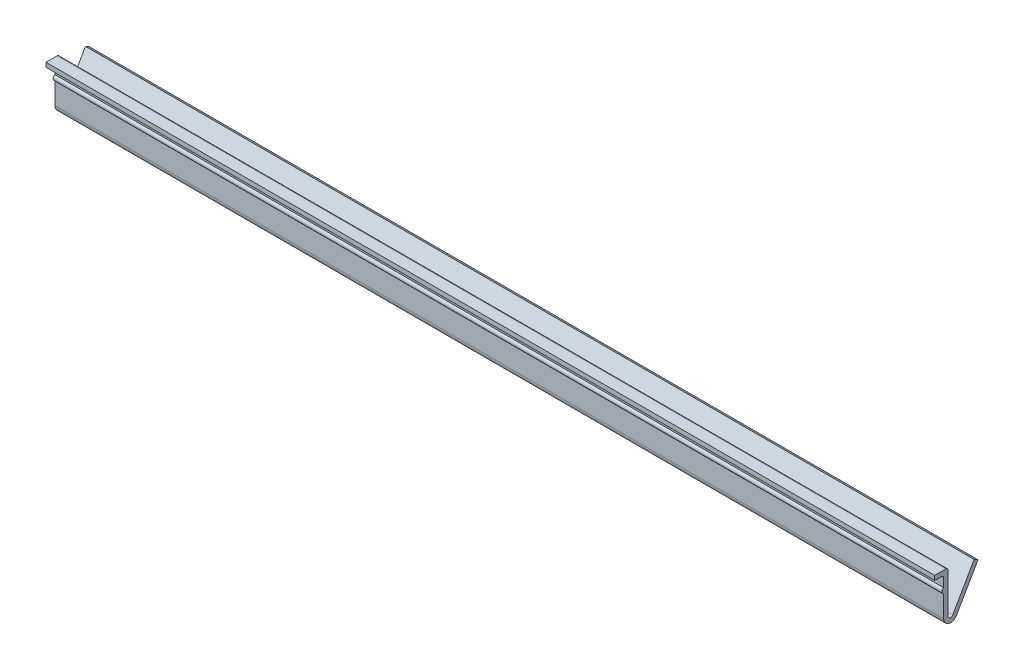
ISO-10303-21;
HEADER;
FILE_DESCRIPTION(('STEP AP214'),'2;1');
FILE_NAME('part.step','',(''),(''),'','','');
FILE_SCHEMA(('AUTOMOTIVE_DESIGN { 1 0 10303 214 1 1 1 1 }'));
ENDSEC;
DATA;
#1=APPLICATION_CONTEXT('core data for automotive mechanical design processes');
#2=APPLICATION_PROTOCOL_DEFINITION('international standard','automotive_design',2000,#1);
#3=PRODUCT_CONTEXT('',#1,'mechanical');
#4=PRODUCT('Part','Part','',(#3));
#5=PRODUCT_RELATED_PRODUCT_CATEGORY('part','',(#4));
#6=PRODUCT_DEFINITION_FORMATION('','',#4);
#7=PRODUCT_DEFINITION_CONTEXT('part definition',#1,'design');
#8=PRODUCT_DEFINITION('design','',#6,#7);
#9=PRODUCT_DEFINITION_SHAPE('','',#8);
#10=(LENGTH_UNIT() NAMED_UNIT(*) SI_UNIT(.MILLI.,.METRE.));
#11=(NAMED_UNIT(*) PLANE_ANGLE_UNIT() SI_UNIT($,.RADIAN.));
#12=(NAMED_UNIT(*) SI_UNIT($,.STERADIAN.) SOLID_ANGLE_UNIT());
#13=UNCERTAINTY_MEASURE_WITH_UNIT(LENGTH_MEASURE(1.E-05),#10,'distance_accuracy_value','');
#14=(GEOMETRIC_REPRESENTATION_CONTEXT(3) GLOBAL_UNCERTAINTY_ASSIGNED_CONTEXT((#13)) GLOBAL_UNIT_ASSIGNED_CONTEXT((#10,
#11,#12)) REPRESENTATION_CONTEXT('',''));
#15=CARTESIAN_POINT('',(0.,0.,0.));
#16=DIRECTION('',(0.,0.,1.));
#17=DIRECTION('',(1.,0.,0.));
#18=AXIS2_PLACEMENT_3D('',#15,#16,#17);
#19=CARTESIAN_POINT('',(200.,6.11762039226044,5.94354760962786));
#20=DIRECTION('',(0.,0.,-1.));
#21=DIRECTION('',(-1.,0.,0.));
#22=AXIS2_PLACEMENT_3D('',#19,#20,#21);
#23=PLANE('',#22);
#24=DIRECTION('',(0.,-1.,0.));
#25=VECTOR('',#24,1.);
#26=CARTESIAN_POINT('',(0.,6.11762039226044,5.94354760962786));
#27=LINE('',#26,#25);
#28=CARTESIAN_POINT('',(0.,6.11762039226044,5.94354760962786));
#29=VERTEX_POINT('',#28);
#30=CARTESIAN_POINT('',(0.,5.11762039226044,5.94354760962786));
#31=VERTEX_POINT('',#30);
#32=EDGE_CURVE('E236',#29,#31,#27,.T.);
#33=ORIENTED_EDGE('',*,*,#32,.T.);
#34=DIRECTION('',(-1.,0.,0.));
#35=VECTOR('',#34,1.);
#36=CARTESIAN_POINT('',(200.,5.11762039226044,5.94354760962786));
#37=LINE('',#36,#35);
#38=CARTESIAN_POINT('',(200.,5.11762039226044,5.94354760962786));
#39=VERTEX_POINT('',#38);
#40=EDGE_CURVE('E13',#39,#31,#37,.T.);
#41=ORIENTED_EDGE('',*,*,#40,.F.);
#42=DIRECTION('',(0.,-1.,0.));
#43=VECTOR('',#42,1.);
#44=CARTESIAN_POINT('',(200.,6.11762039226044,5.94354760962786));
#45=LINE('',#44,#43);
#46=CARTESIAN_POINT('',(200.,6.11762039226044,5.94354760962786));
#47=VERTEX_POINT('',#46);
#48=EDGE_CURVE('E276',#47,#39,#45,.T.);
#49=ORIENTED_EDGE('',*,*,#48,.F.);
#50=DIRECTION('',(-1.,0.,0.));
#51=VECTOR('',#50,1.);
#52=CARTESIAN_POINT('',(200.,6.11762039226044,5.94354760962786));
#53=LINE('',#52,#51);
#54=EDGE_CURVE('E232',#47,#29,#53,.T.);
#55=ORIENTED_EDGE('',*,*,#54,.T.);
#56=EDGE_LOOP('',(#33,#41,#49,#55));
#57=FACE_BOUND('',#56,.T.);
#58=ADVANCED_FACE('F96',(#57),#23,.F.);
#59=CARTESIAN_POINT('',(200.,5.11762039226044,5.94354760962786));
#60=DIRECTION('',(0.,1.,0.));
#61=DIRECTION('',(0.,0.,1.));
#62=AXIS2_PLACEMENT_3D('',#59,#60,#61);
#63=PLANE('',#62);
#64=DIRECTION('',(0.,0.,-1.));
#65=VECTOR('',#64,1.);
#66=CARTESIAN_POINT('',(0.,5.11762039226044,5.94354760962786));
#67=LINE('',#66,#65);
#68=CARTESIAN_POINT('',(0.,5.11762039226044,4.44354760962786));
#69=VERTEX_POINT('',#68);
#70=EDGE_CURVE('E240',#31,#69,#67,.T.);
#71=ORIENTED_EDGE('',*,*,#70,.T.);
#72=DIRECTION('',(-1.,0.,0.));
#73=VECTOR('',#72,1.);
#74=CARTESIAN_POINT('',(200.,5.11762039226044,4.44354760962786));
#75=LINE('',#74,#73);
#76=CARTESIAN_POINT('',(200.,5.11762039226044,4.44354760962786));
#77=VERTEX_POINT('',#76);
#78=EDGE_CURVE('E105',#77,#69,#75,.T.);
#79=ORIENTED_EDGE('',*,*,#78,.F.);
#80=DIRECTION('',(0.,0.,-1.));
#81=VECTOR('',#80,1.);
#82=CARTESIAN_POINT('',(200.,5.11762039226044,5.94354760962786));
#83=LINE('',#82,#81);
#84=EDGE_CURVE('E174',#39,#77,#83,.T.);
#85=ORIENTED_EDGE('',*,*,#84,.F.);
#86=ORIENTED_EDGE('',*,*,#40,.T.);
#87=EDGE_LOOP('',(#71,#79,#85,#86));
#88=FACE_BOUND('',#87,.T.);
#89=ADVANCED_FACE('F407',(#88),#63,.F.);
#90=CARTESIAN_POINT('',(200.,4.61762039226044,4.44354760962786));
#91=DIRECTION('',(-1.,0.,0.));
#92=DIRECTION('',(0.,0.,1.));
#93=AXIS2_PLACEMENT_3D('',#90,#91,#92);
#94=CYLINDRICAL_SURFACE('',#93,0.5);
#95=CARTESIAN_POINT('',(0.,4.61762039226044,4.44354760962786));
#96=DIRECTION('',(-1.,0.,0.));
#97=DIRECTION('',(0.,0.,1.));
#98=AXIS2_PLACEMENT_3D('',#95,#96,#97);
#99=CIRCLE('',#98,0.5);
#100=CARTESIAN_POINT('',(0.,4.61762039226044,3.94354760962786));
#101=VERTEX_POINT('',#100);
#102=EDGE_CURVE('E243',#69,#101,#99,.T.);
#103=ORIENTED_EDGE('',*,*,#102,.T.);
#104=DIRECTION('',(-1.,0.,0.));
#105=VECTOR('',#104,1.);
#106=CARTESIAN_POINT('',(200.,4.61762039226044,3.94354760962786));
#107=LINE('',#106,#105);
#108=CARTESIAN_POINT('',(200.,4.61762039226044,3.94354760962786));
#109=VERTEX_POINT('',#108);
#110=EDGE_CURVE('E311',#109,#101,#107,.T.);
#111=ORIENTED_EDGE('',*,*,#110,.F.);
#112=CARTESIAN_POINT('',(200.,4.61762039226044,4.44354760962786));
#113=DIRECTION('',(-1.,0.,0.));
#114=DIRECTION('',(0.,0.,1.));
#115=AXIS2_PLACEMENT_3D('',#112,#113,#114);
#116=CIRCLE('',#115,0.5);
#117=EDGE_CURVE('E322',#77,#109,#116,.T.);
#118=ORIENTED_EDGE('',*,*,#117,.F.);
#119=ORIENTED_EDGE('',*,*,#78,.T.);
#120=EDGE_LOOP('',(#103,#111,#118,#119));
#121=FACE_BOUND('',#120,.T.);
#122=ADVANCED_FACE('F320',(#121),#94,.F.);
#123=CARTESIAN_POINT('',(200.,4.61762039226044,3.94354760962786));
#124=DIRECTION('',(0.,0.,-1.));
#125=DIRECTION('',(0.,1.,0.));
#126=AXIS2_PLACEMENT_3D('',#123,#124,#125);
#127=PLANE('',#126);
#128=DIRECTION('',(0.,-1.,0.));
#129=VECTOR('',#128,1.);
#130=CARTESIAN_POINT('',(0.,4.61762039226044,3.94354760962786));
#131=LINE('',#130,#129);
#132=CARTESIAN_POINT('',(0.,2.71736327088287,3.94354760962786));
#133=VERTEX_POINT('',#132);
#134=EDGE_CURVE('E246',#101,#133,#131,.T.);
#135=ORIENTED_EDGE('',*,*,#134,.T.);
#136=DIRECTION('',(-1.,0.,0.));
#137=VECTOR('',#136,1.);
#138=CARTESIAN_POINT('',(200.,2.71736327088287,3.94354760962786));
#139=LINE('',#138,#137);
#140=CARTESIAN_POINT('',(200.,2.71736327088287,3.94354760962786));
#141=VERTEX_POINT('',#140);
#142=EDGE_CURVE('E307',#141,#133,#139,.T.);
#143=ORIENTED_EDGE('',*,*,#142,.F.);
#144=DIRECTION('',(0.,-1.,0.));
#145=VECTOR('',#144,1.);
#146=CARTESIAN_POINT('',(200.,4.61762039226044,3.94354760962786));
#147=LINE('',#146,#145);
#148=EDGE_CURVE('E341',#109,#141,#147,.T.);
#149=ORIENTED_EDGE('',*,*,#148,.F.);
#150=ORIENTED_EDGE('',*,*,#110,.T.);
#151=EDGE_LOOP('',(#135,#143,#149,#150));
#152=FACE_BOUND('',#151,.T.);
#153=ADVANCED_FACE('F331',(#152),#127,.F.);
#154=CARTESIAN_POINT('',(200.,2.11762039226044,3.69293140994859));
#155=DIRECTION('',(-1.,0.,0.));
#156=DIRECTION('',(0.,0.,1.));
#157=AXIS2_PLACEMENT_3D('',#154,#155,#156);
#158=CYLINDRICAL_SURFACE('',#157,0.65);
#159=CARTESIAN_POINT('',(0.,2.11762039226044,3.69293140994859));
#160=DIRECTION('',(1.,0.,0.));
#161=DIRECTION('',(0.,0.,-1.));
#162=AXIS2_PLACEMENT_3D('',#159,#160,#161);
#163=CIRCLE('',#162,0.65);
#164=CARTESIAN_POINT('',(0.,1.517877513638,3.94354760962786));
#165=VERTEX_POINT('',#164);
#166=EDGE_CURVE('E249',#133,#165,#163,.T.);
#167=ORIENTED_EDGE('',*,*,#166,.T.);
#168=DIRECTION('',(-1.,0.,0.));
#169=VECTOR('',#168,1.);
#170=CARTESIAN_POINT('',(200.,1.517877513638,3.94354760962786));
#171=LINE('',#170,#169);
#172=CARTESIAN_POINT('',(200.,1.517877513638,3.94354760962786));
#173=VERTEX_POINT('',#172);
#174=EDGE_CURVE('E303',#173,#165,#171,.T.);
#175=ORIENTED_EDGE('',*,*,#174,.F.);
#176=CARTESIAN_POINT('',(200.,2.11762039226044,3.69293140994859));
#177=DIRECTION('',(1.,0.,0.));
#178=DIRECTION('',(0.,0.,-1.));
#179=AXIS2_PLACEMENT_3D('',#176,#177,#178);
#180=CIRCLE('',#179,0.65);
#181=EDGE_CURVE('E337',#141,#173,#180,.T.);
#182=ORIENTED_EDGE('',*,*,#181,.F.);
#183=ORIENTED_EDGE('',*,*,#142,.T.);
#184=EDGE_LOOP('',(#167,#175,#182,#183));
#185=FACE_BOUND('',#184,.T.);
#186=ADVANCED_FACE('F335',(#185),#158,.T.);
#187=CARTESIAN_POINT('',(200.,1.517877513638,3.94354760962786));
#188=DIRECTION('',(0.,0.,-1.));
#189=DIRECTION('',(0.,1.,0.));
#190=AXIS2_PLACEMENT_3D('',#187,#188,#189);
#191=PLANE('',#190);
#192=DIRECTION('',(0.,-1.,0.));
#193=VECTOR('',#192,1.);
#194=CARTESIAN_POINT('',(0.,1.517877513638,3.94354760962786));
#195=LINE('',#194,#193);
#196=CARTESIAN_POINT('',(0.,-3.33533918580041,3.94354760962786));
#197=VERTEX_POINT('',#196);
#198=EDGE_CURVE('E252',#165,#197,#195,.T.);
#199=ORIENTED_EDGE('',*,*,#198,.T.);
#200=DIRECTION('',(-1.,0.,0.));
#201=VECTOR('',#200,1.);
#202=CARTESIAN_POINT('',(200.,-3.33533918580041,3.94354760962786));
#203=LINE('',#202,#201);
#204=CARTESIAN_POINT('',(200.,-3.33533918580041,3.94354760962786));
#205=VERTEX_POINT('',#204);
#206=EDGE_CURVE('E299',#205,#197,#203,.T.);
#207=ORIENTED_EDGE('',*,*,#206,.F.);
#208=DIRECTION('',(0.,-1.,0.));
#209=VECTOR('',#208,1.);
#210=CARTESIAN_POINT('',(200.,1.517877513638,3.94354760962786));
#211=LINE('',#210,#209);
#212=EDGE_CURVE('E340',#173,#205,#211,.T.);
#213=ORIENTED_EDGE('',*,*,#212,.F.);
#214=ORIENTED_EDGE('',*,*,#174,.T.);
#215=EDGE_LOOP('',(#199,#207,#213,#214));
#216=FACE_BOUND('',#215,.T.);
#217=ADVANCED_FACE('F419',(#216),#191,.F.);
#218=CARTESIAN_POINT('',(200.,-3.33533918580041,2.37739924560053));
#219=DIRECTION('',(-1.,0.,0.));
#220=DIRECTION('',(0.,0.,1.));
#221=AXIS2_PLACEMENT_3D('',#218,#219,#220);
#222=CYLINDRICAL_SURFACE('',#221,1.56614836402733);
#223=CARTESIAN_POINT('',(0.,-3.33533918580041,2.37739924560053));
#224=DIRECTION('',(1.,0.,0.));
#225=DIRECTION('',(0.,0.,-1.));
#226=AXIS2_PLACEMENT_3D('',#223,#224,#225);
#227=CIRCLE('',#226,1.56614836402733);
#228=CARTESIAN_POINT('',(0.,-4.11501340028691,1.01911767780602));
#229=VERTEX_POINT('',#228);
#230=EDGE_CURVE('E255',#197,#229,#227,.T.);
#231=ORIENTED_EDGE('',*,*,#230,.T.);
#232=DIRECTION('',(-1.,0.,0.));
#233=VECTOR('',#232,1.);
#234=CARTESIAN_POINT('',(200.,-4.11501340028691,1.01911767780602));
#235=LINE('',#234,#233);
#236=CARTESIAN_POINT('',(200.,-4.11501340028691,1.01911767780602));
#237=VERTEX_POINT('',#236);
#238=EDGE_CURVE('E295',#237,#229,#235,.T.);
#239=ORIENTED_EDGE('',*,*,#238,.F.);
#240=CARTESIAN_POINT('',(200.,-3.33533918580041,2.37739924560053));
#241=DIRECTION('',(1.,0.,0.));
#242=DIRECTION('',(0.,0.,-1.));
#243=AXIS2_PLACEMENT_3D('',#240,#241,#242);
#244=CIRCLE('',#243,1.56614836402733);
#245=EDGE_CURVE('E347',#205,#237,#244,.T.);
#246=ORIENTED_EDGE('',*,*,#245,.F.);
#247=ORIENTED_EDGE('',*,*,#206,.T.);
#248=EDGE_LOOP('',(#231,#239,#246,#247));
#249=FACE_BOUND('',#248,.T.);
#250=ADVANCED_FACE('F422',(#249),#222,.T.);
#251=CARTESIAN_POINT('',(200.,-4.11501340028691,1.01911767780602));
#252=DIRECTION('',(0.,0.497829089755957,0.867275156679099));
#253=DIRECTION('',(0.,-0.867275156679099,0.497829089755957));
#254=AXIS2_PLACEMENT_3D('',#251,#252,#253);
#255=PLANE('',#254);
#256=DIRECTION('',(0.,0.867275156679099,-0.497829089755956));
#257=VECTOR('',#256,1.);
#258=CARTESIAN_POINT('',(0.,-4.11501340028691,1.01911767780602));
#259=LINE('',#258,#257);
#260=CARTESIAN_POINT('',(0.,4.2795649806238,-3.79949759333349));
#261=VERTEX_POINT('',#260);
#262=EDGE_CURVE('E258',#229,#261,#259,.T.);
#263=ORIENTED_EDGE('',*,*,#262,.T.);
#264=DIRECTION('',(-1.,0.,0.));
#265=VECTOR('',#264,1.);
#266=CARTESIAN_POINT('',(200.,4.2795649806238,-3.79949759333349));
#267=LINE('',#266,#265);
#268=CARTESIAN_POINT('',(200.,4.2795649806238,-3.79949759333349));
#269=VERTEX_POINT('',#268);
#270=EDGE_CURVE('E291',#269,#261,#267,.T.);
#271=ORIENTED_EDGE('',*,*,#270,.F.);
#272=DIRECTION('',(0.,0.867275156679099,-0.497829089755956));
#273=VECTOR('',#272,1.);
#274=CARTESIAN_POINT('',(200.,-4.11501340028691,1.01911767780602));
#275=LINE('',#274,#273);
#276=EDGE_CURVE('E355',#237,#269,#275,.T.);
#277=ORIENTED_EDGE('',*,*,#276,.F.);
#278=ORIENTED_EDGE('',*,*,#238,.T.);
#279=EDGE_LOOP('',(#263,#271,#277,#278));
#280=FACE_BOUND('',#279,.T.);
#281=ADVANCED_FACE('F426',(#280),#255,.F.);
#282=CARTESIAN_POINT('',(200.,4.77739407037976,-2.93222243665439));
#283=DIRECTION('',(0.,-0.867275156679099,0.497829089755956));
#284=DIRECTION('',(0.,-0.497829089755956,-0.867275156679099));
#285=AXIS2_PLACEMENT_3D('',#282,#283,#284);
#286=PLANE('',#285);
#287=DIRECTION('',(0.,0.497829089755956,0.867275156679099));
#288=VECTOR('',#287,1.);
#289=CARTESIAN_POINT('',(0.,4.77739407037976,-2.93222243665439));
#290=LINE('',#289,#288);
#291=CARTESIAN_POINT('',(0.,4.77739407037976,-2.93222243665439));
#292=VERTEX_POINT('',#291);
#293=EDGE_CURVE('E261',#261,#292,#290,.T.);
#294=ORIENTED_EDGE('',*,*,#293,.T.);
#295=DIRECTION('',(-1.,0.,0.));
#296=VECTOR('',#295,1.);
#297=CARTESIAN_POINT('',(200.,4.77739407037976,-2.93222243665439));
#298=LINE('',#297,#296);
#299=CARTESIAN_POINT('',(200.,4.77739407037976,-2.93222243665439));
#300=VERTEX_POINT('',#299);
#301=EDGE_CURVE('E287',#300,#292,#298,.T.);
#302=ORIENTED_EDGE('',*,*,#301,.F.);
#303=DIRECTION('',(0.,0.497829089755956,0.867275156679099));
#304=VECTOR('',#303,1.);
#305=CARTESIAN_POINT('',(200.,4.77739407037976,-2.93222243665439));
#306=LINE('',#305,#304);
#307=EDGE_CURVE('E357',#269,#300,#306,.T.);
#308=ORIENTED_EDGE('',*,*,#307,.F.);
#309=ORIENTED_EDGE('',*,*,#270,.T.);
#310=EDGE_LOOP('',(#294,#302,#308,#309));
#311=FACE_BOUND('',#310,.T.);
#312=ADVANCED_FACE('F430',(#311),#286,.F.);
#313=CARTESIAN_POINT('',(200.,-3.61718431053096,1.88639283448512));
#314=DIRECTION('',(0.,-0.497829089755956,-0.867275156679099));
#315=DIRECTION('',(0.,0.867275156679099,-0.497829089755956));
#316=AXIS2_PLACEMENT_3D('',#313,#314,#315);
#317=PLANE('',#316);
#318=DIRECTION('',(0.,-0.867275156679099,0.497829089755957));
#319=VECTOR('',#318,1.);
#320=CARTESIAN_POINT('',(0.,-3.61718431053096,1.88639283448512));
#321=LINE('',#320,#319);
#322=CARTESIAN_POINT('',(0.,-3.61718431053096,1.88639283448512));
#323=VERTEX_POINT('',#322);
#324=EDGE_CURVE('E264',#292,#323,#321,.T.);
#325=ORIENTED_EDGE('',*,*,#324,.T.);
#326=DIRECTION('',(-1.,0.,0.));
#327=VECTOR('',#326,1.);
#328=CARTESIAN_POINT('',(200.,-3.61718431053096,1.88639283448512));
#329=LINE('',#328,#327);
#330=CARTESIAN_POINT('',(200.,-3.61718431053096,1.88639283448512));
#331=VERTEX_POINT('',#330);
#332=EDGE_CURVE('E283',#331,#323,#329,.T.);
#333=ORIENTED_EDGE('',*,*,#332,.F.);
#334=DIRECTION('',(0.,-0.867275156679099,0.497829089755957));
#335=VECTOR('',#334,1.);
#336=CARTESIAN_POINT('',(200.,-3.61718431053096,1.88639283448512));
#337=LINE('',#336,#335);
#338=EDGE_CURVE('E360',#300,#331,#337,.T.);
#339=ORIENTED_EDGE('',*,*,#338,.F.);
#340=ORIENTED_EDGE('',*,*,#301,.T.);
#341=EDGE_LOOP('',(#325,#333,#339,#340));
#342=FACE_BOUND('',#341,.T.);
#343=ADVANCED_FACE('F434',(#342),#317,.F.);
#344=CARTESIAN_POINT('',(200.,-3.33533918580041,2.37739924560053));
#345=DIRECTION('',(-1.,0.,0.));
#346=DIRECTION('',(0.,0.,1.));
#347=AXIS2_PLACEMENT_3D('',#344,#345,#346);
#348=CYLINDRICAL_SURFACE('',#347,0.566148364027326);
#349=CARTESIAN_POINT('',(0.,-3.33533918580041,2.37739924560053));
#350=DIRECTION('',(-1.,0.,0.));
#351=DIRECTION('',(0.,0.,-1.));
#352=AXIS2_PLACEMENT_3D('',#349,#350,#351);
#353=CIRCLE('',#352,0.566148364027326);
#354=CARTESIAN_POINT('',(0.,-3.33533918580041,2.94354760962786));
#355=VERTEX_POINT('',#354);
#356=EDGE_CURVE('E267',#323,#355,#353,.T.);
#357=ORIENTED_EDGE('',*,*,#356,.T.);
#358=DIRECTION('',(-1.,0.,0.));
#359=VECTOR('',#358,1.);
#360=CARTESIAN_POINT('',(200.,-3.33533918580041,2.94354760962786));
#361=LINE('',#360,#359);
#362=CARTESIAN_POINT('',(200.,-3.33533918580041,2.94354760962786));
#363=VERTEX_POINT('',#362);
#364=EDGE_CURVE('E222',#363,#355,#361,.T.);
#365=ORIENTED_EDGE('',*,*,#364,.F.);
#366=CARTESIAN_POINT('',(200.,-3.33533918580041,2.37739924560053));
#367=DIRECTION('',(-1.,0.,0.));
#368=DIRECTION('',(0.,0.,-1.));
#369=AXIS2_PLACEMENT_3D('',#366,#367,#368);
#370=CIRCLE('',#369,0.566148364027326);
#371=EDGE_CURVE('E211',#331,#363,#370,.T.);
#372=ORIENTED_EDGE('',*,*,#371,.F.);
#373=ORIENTED_EDGE('',*,*,#332,.T.);
#374=EDGE_LOOP('',(#357,#365,#372,#373));
#375=FACE_BOUND('',#374,.T.);
#376=ADVANCED_FACE('F438',(#375),#348,.F.);
#377=CARTESIAN_POINT('',(200.,5.61762039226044,2.94354760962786));
#378=DIRECTION('',(0.,0.,1.));
#379=DIRECTION('',(0.,-1.,0.));
#380=AXIS2_PLACEMENT_3D('',#377,#378,#379);
#381=PLANE('',#380);
#382=DIRECTION('',(0.,1.,0.));
#383=VECTOR('',#382,1.);
#384=CARTESIAN_POINT('',(0.,5.61762039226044,2.94354760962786));
#385=LINE('',#384,#383);
#386=CARTESIAN_POINT('',(0.,5.61762039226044,2.94354760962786));
#387=VERTEX_POINT('',#386);
#388=EDGE_CURVE('E220',#355,#387,#385,.T.);
#389=ORIENTED_EDGE('',*,*,#388,.T.);
#390=DIRECTION('',(-1.,0.,0.));
#391=VECTOR('',#390,1.);
#392=CARTESIAN_POINT('',(200.,5.61762039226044,2.94354760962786));
#393=LINE('',#392,#391);
#394=CARTESIAN_POINT('',(200.,5.61762039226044,2.94354760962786));
#395=VERTEX_POINT('',#394);
#396=EDGE_CURVE('E217',#395,#387,#393,.T.);
#397=ORIENTED_EDGE('',*,*,#396,.F.);
#398=DIRECTION('',(0.,1.,0.));
#399=VECTOR('',#398,1.);
#400=CARTESIAN_POINT('',(200.,5.61762039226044,2.94354760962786));
#401=LINE('',#400,#399);
#402=EDGE_CURVE('E205',#363,#395,#401,.T.);
#403=ORIENTED_EDGE('',*,*,#402,.F.);
#404=ORIENTED_EDGE('',*,*,#364,.T.);
#405=EDGE_LOOP('',(#389,#397,#403,#404));
#406=FACE_BOUND('',#405,.T.);
#407=ADVANCED_FACE('F218',(#406),#381,.F.);
#408=CARTESIAN_POINT('',(200.,5.61762039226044,3.44354760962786));
#409=DIRECTION('',(-1.,0.,0.));
#410=DIRECTION('',(0.,0.,1.));
#411=AXIS2_PLACEMENT_3D('',#408,#409,#410);
#412=CYLINDRICAL_SURFACE('',#411,0.5);
#413=CARTESIAN_POINT('',(0.,5.61762039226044,3.44354760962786));
#414=DIRECTION('',(1.,0.,0.));
#415=DIRECTION('',(0.,0.,1.));
#416=AXIS2_PLACEMENT_3D('',#413,#414,#415);
#417=CIRCLE('',#416,0.5);
#418=CARTESIAN_POINT('',(0.,6.11762039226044,3.44354760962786));
#419=VERTEX_POINT('',#418);
#420=EDGE_CURVE('E160',#387,#419,#417,.T.);
#421=ORIENTED_EDGE('',*,*,#420,.T.);
#422=DIRECTION('',(-1.,0.,0.));
#423=VECTOR('',#422,1.);
#424=CARTESIAN_POINT('',(200.,6.11762039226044,3.44354760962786));
#425=LINE('',#424,#423);
#426=CARTESIAN_POINT('',(200.,6.11762039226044,3.44354760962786));
#427=VERTEX_POINT('',#426);
#428=EDGE_CURVE('E223',#427,#419,#425,.T.);
#429=ORIENTED_EDGE('',*,*,#428,.F.);
#430=CARTESIAN_POINT('',(200.,5.61762039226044,3.44354760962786));
#431=DIRECTION('',(1.,0.,0.));
#432=DIRECTION('',(0.,0.,1.));
#433=AXIS2_PLACEMENT_3D('',#430,#431,#432);
#434=CIRCLE('',#433,0.5);
#435=EDGE_CURVE('E209',#395,#427,#434,.T.);
#436=ORIENTED_EDGE('',*,*,#435,.F.);
#437=ORIENTED_EDGE('',*,*,#396,.T.);
#438=EDGE_LOOP('',(#421,#429,#436,#437));
#439=FACE_BOUND('',#438,.T.);
#440=ADVANCED_FACE('F225',(#439),#412,.T.);
#441=CARTESIAN_POINT('',(200.,6.11762039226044,5.94354760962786));
#442=DIRECTION('',(0.,-1.,0.));
#443=DIRECTION('',(0.,0.,-1.));
#444=AXIS2_PLACEMENT_3D('',#441,#442,#443);
#445=PLANE('',#444);
#446=DIRECTION('',(0.,0.,1.));
#447=VECTOR('',#446,1.);
#448=CARTESIAN_POINT('',(0.,6.11762039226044,5.94354760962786));
#449=LINE('',#448,#447);
#450=EDGE_CURVE('E166',#419,#29,#449,.T.);
#451=ORIENTED_EDGE('',*,*,#450,.T.);
#452=ORIENTED_EDGE('',*,*,#54,.F.);
#453=DIRECTION('',(0.,0.,1.));
#454=VECTOR('',#453,1.);
#455=CARTESIAN_POINT('',(200.,6.11762039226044,5.94354760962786));
#456=LINE('',#455,#454);
#457=EDGE_CURVE('E113',#427,#47,#456,.T.);
#458=ORIENTED_EDGE('',*,*,#457,.F.);
#459=ORIENTED_EDGE('',*,*,#428,.T.);
#460=EDGE_LOOP('',(#451,#452,#458,#459));
#461=FACE_BOUND('',#460,.T.);
#462=ADVANCED_FACE('F447',(#461),#445,.F.);
#463=CARTESIAN_POINT('',(200.,4.61762039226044,4.44354760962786));
#464=DIRECTION('',(-1.,0.,0.));
#465=DIRECTION('',(0.,0.,1.));
#466=AXIS2_PLACEMENT_3D('',#463,#464,#465);
#467=PLANE('',#466);
#468=ORIENTED_EDGE('',*,*,#48,.T.);
#469=ORIENTED_EDGE('',*,*,#84,.T.);
#470=ORIENTED_EDGE('',*,*,#117,.T.);
#471=ORIENTED_EDGE('',*,*,#148,.T.);
#472=ORIENTED_EDGE('',*,*,#181,.T.);
#473=ORIENTED_EDGE('',*,*,#212,.T.);
#474=ORIENTED_EDGE('',*,*,#245,.T.);
#475=ORIENTED_EDGE('',*,*,#276,.T.);
#476=ORIENTED_EDGE('',*,*,#307,.T.);
#477=ORIENTED_EDGE('',*,*,#338,.T.);
#478=ORIENTED_EDGE('',*,*,#371,.T.);
#479=ORIENTED_EDGE('',*,*,#402,.T.);
#480=ORIENTED_EDGE('',*,*,#435,.T.);
#481=ORIENTED_EDGE('',*,*,#457,.T.);
#482=EDGE_LOOP('',(#468,#469,#470,#471,#472,#473,#474,#475,#476,#477,#478,#479,#480,#481));
#483=FACE_BOUND('',#482,.T.);
#484=ADVANCED_FACE('F207',(#483),#467,.F.);
#485=CARTESIAN_POINT('',(0.,4.61762039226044,4.44354760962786));
#486=DIRECTION('',(-1.,0.,0.));
#487=DIRECTION('',(0.,0.,1.));
#488=AXIS2_PLACEMENT_3D('',#485,#486,#487);
#489=PLANE('',#488);
#490=ORIENTED_EDGE('',*,*,#32,.F.);
#491=ORIENTED_EDGE('',*,*,#450,.F.);
#492=ORIENTED_EDGE('',*,*,#420,.F.);
#493=ORIENTED_EDGE('',*,*,#388,.F.);
#494=ORIENTED_EDGE('',*,*,#356,.F.);
#495=ORIENTED_EDGE('',*,*,#324,.F.);
#496=ORIENTED_EDGE('',*,*,#293,.F.);
#497=ORIENTED_EDGE('',*,*,#262,.F.);
#498=ORIENTED_EDGE('',*,*,#230,.F.);
#499=ORIENTED_EDGE('',*,*,#198,.F.);
#500=ORIENTED_EDGE('',*,*,#166,.F.);
#501=ORIENTED_EDGE('',*,*,#134,.F.);
#502=ORIENTED_EDGE('',*,*,#102,.F.);
#503=ORIENTED_EDGE('',*,*,#70,.F.);
#504=EDGE_LOOP('',(#490,#491,#492,#493,#494,#495,#496,#497,#498,#499,#500,#501,#502,#503));
#505=FACE_BOUND('',#504,.T.);
#506=ADVANCED_FACE('F326',(#505),#489,.T.);
#507=CLOSED_SHELL('',(#58,#89,#122,#153,#186,#217,#250,#281,#312,#343,#376,#407,#440,#462,#484,#506));
#508=MANIFOLD_SOLID_BREP('B2',#507);
#509=ADVANCED_BREP_SHAPE_REPRESENTATION('',(#18,#508),#14);
#510=SHAPE_DEFINITION_REPRESENTATION(#9,#509);
ENDSEC;
END-ISO-10303-21;
